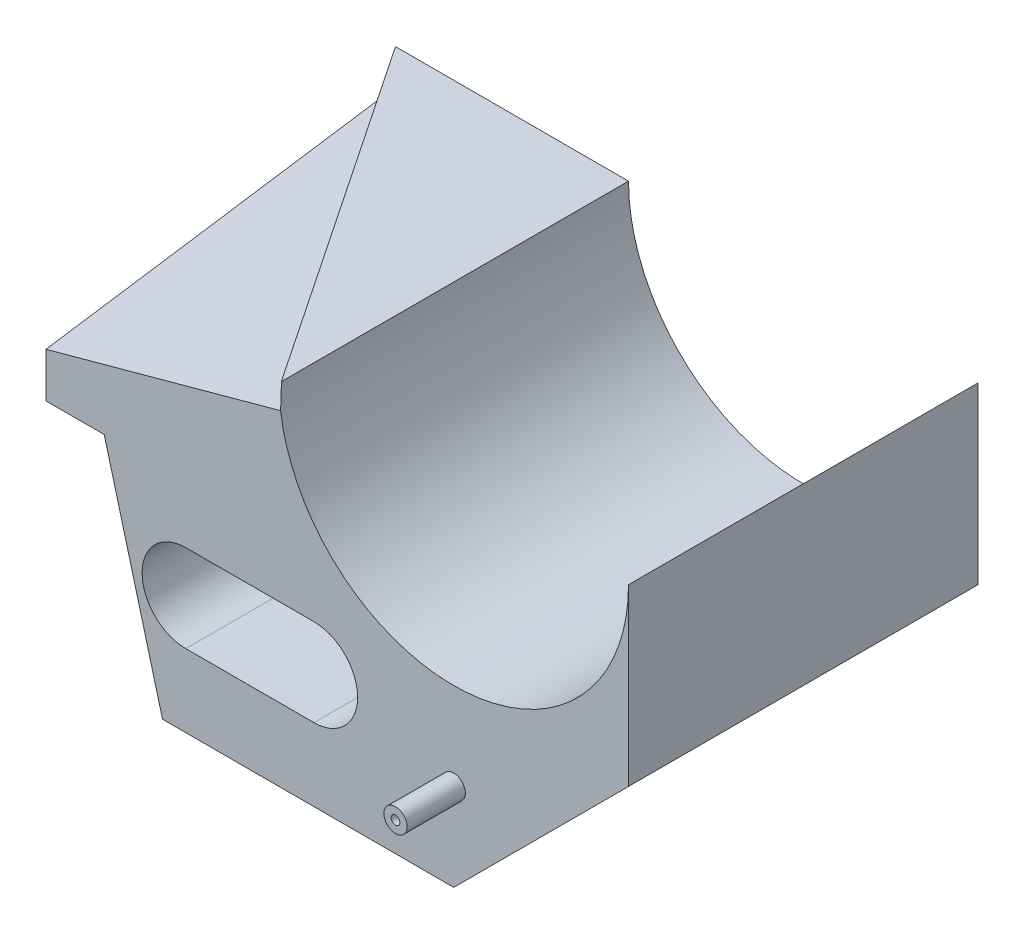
from build123d import *

# Parameters (mm, degrees)
BOSS_EXTRUDE1_DEPTH = 30
CUT_EXTRUDE1_DEPTH  = 40
CUT_EXTRUDE2_DEPTH  = 135.665989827
SKETCH3_R           = 2
SKETCH3_R_2         = 0.75
BOSS_EXTRUDE2_DEPTH = 10


with BuildPart() as part:
    # Sketch1 → Boss-Extrude1 (new, symmetric)
    with BuildSketch(Plane.XY):
        with BuildLine():
            Line((0, 0), (50, 0))
            Line((50, 0), (80, 30))
            Line((80, 30), (80, 60))
            ThreePointArc((80, 60), (50, 30), (20, 60))
            Line((20, 60), (-20, 60))
            Line((-20, 60), (-20, 37.320508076))
            Line((-20, 37.320508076), (-10, 37.320508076))
            Line((-10, 37.320508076), (0, 0))
        make_face()
    extrude(amount=BOSS_EXTRUDE1_DEPTH, both=True)

    # Sketch2 → Cut-Extrude1 (cut)
    with BuildSketch(Plane.XY.offset(30)):
        with BuildLine():
            Line((4, 27.5), (26, 27.5))
            ThreePointArc((26, 27.5), (33.5, 20), (26, 12.5))
            Line((26, 12.5), (4, 12.5))
            ThreePointArc((4, 12.5), (-3.5, 20), (4, 27.5))
        make_face()
    extrude(amount=-CUT_EXTRUDE1_DEPTH, mode=Mode.SUBTRACT)

    # 3DSketch1 → Cut-Extrude2 (cut, through all, along a direction that is not the sketch's normal)
    with BuildSketch(Plane(origin=(-20, 54, -30), x_dir=(0.5570372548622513, 0.027790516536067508, 0.8300223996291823), z_dir=(0.2610032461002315, -0.954657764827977, -0.1431986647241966))):
        Polygon((0, 0), (49.551229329, 35.009651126), (72.287205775, 0), align=None)
    extrude(amount=-CUT_EXTRUDE2_DEPTH, dir=(0, -1, 0), mode=Mode.SUBTRACT)

    # Sketch3 → Boss-Extrude2 (add)
    with BuildSketch(Plane.XY.offset(30)):
        with Locations(Location((50, 15, 0), (0, 0, 180))):
            Circle(SKETCH3_R)
        with Locations((50, 15)):
            Circle(SKETCH3_R_2, mode=Mode.SUBTRACT)
    extrude(amount=BOSS_EXTRUDE2_DEPTH)


solid = part.part
